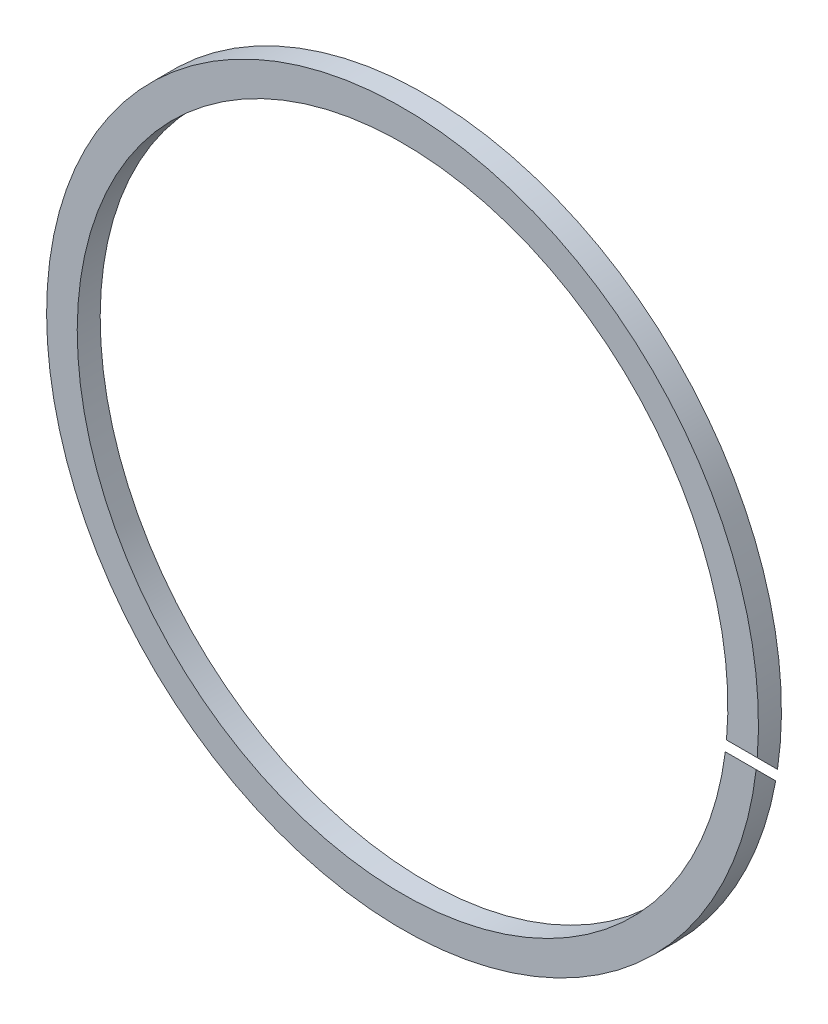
ISO-10303-21;
HEADER;
FILE_DESCRIPTION(('STEP AP214'),'2;1');
FILE_NAME('part.step','',(''),(''),'','','');
FILE_SCHEMA(('AUTOMOTIVE_DESIGN { 1 0 10303 214 1 1 1 1 }'));
ENDSEC;
DATA;
#1=APPLICATION_CONTEXT('core data for automotive mechanical design processes');
#2=APPLICATION_PROTOCOL_DEFINITION('international standard','automotive_design',2000,#1);
#3=PRODUCT_CONTEXT('',#1,'mechanical');
#4=PRODUCT('Part','Part','',(#3));
#5=PRODUCT_RELATED_PRODUCT_CATEGORY('part','',(#4));
#6=PRODUCT_DEFINITION_FORMATION('','',#4);
#7=PRODUCT_DEFINITION_CONTEXT('part definition',#1,'design');
#8=PRODUCT_DEFINITION('design','',#6,#7);
#9=PRODUCT_DEFINITION_SHAPE('','',#8);
#10=(LENGTH_UNIT() NAMED_UNIT(*) SI_UNIT(.MILLI.,.METRE.));
#11=(NAMED_UNIT(*) PLANE_ANGLE_UNIT() SI_UNIT($,.RADIAN.));
#12=(NAMED_UNIT(*) SI_UNIT($,.STERADIAN.) SOLID_ANGLE_UNIT());
#13=UNCERTAINTY_MEASURE_WITH_UNIT(LENGTH_MEASURE(1.E-05),#10,'distance_accuracy_value','');
#14=(GEOMETRIC_REPRESENTATION_CONTEXT(3) GLOBAL_UNCERTAINTY_ASSIGNED_CONTEXT((#13)) GLOBAL_UNIT_ASSIGNED_CONTEXT((#10,
#11,#12)) REPRESENTATION_CONTEXT('',''));
#15=CARTESIAN_POINT('',(0.,0.,0.));
#16=DIRECTION('',(0.,0.,1.));
#17=DIRECTION('',(1.,0.,0.));
#18=AXIS2_PLACEMENT_3D('',#15,#16,#17);
#19=CARTESIAN_POINT('',(0.,0.,1.5));
#20=DIRECTION('',(0.,0.,1.));
#21=DIRECTION('',(1.,0.,0.));
#22=AXIS2_PLACEMENT_3D('',#19,#20,#21);
#23=PLANE('',#22);
#24=DIRECTION('',(1.,0.,0.));
#25=VECTOR('',#24,1.);
#26=CARTESIAN_POINT('',(46.501,-3.88899602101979,1.5));
#27=LINE('',#26,#25);
#28=CARTESIAN_POINT('',(42.3216931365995,-3.88899602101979,1.5));
#29=VERTEX_POINT('',#28);
#30=CARTESIAN_POINT('',(46.3370878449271,-3.88899602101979,1.5));
#31=VERTEX_POINT('',#30);
#32=EDGE_CURVE('E53',#29,#31,#27,.T.);
#33=ORIENTED_EDGE('',*,*,#32,.T.);
#34=CARTESIAN_POINT('',(0.,0.,1.5));
#35=DIRECTION('',(0.,0.,1.));
#36=DIRECTION('',(1.,0.,0.));
#37=AXIS2_PLACEMENT_3D('',#34,#35,#36);
#38=CIRCLE('',#37,46.5);
#39=CARTESIAN_POINT('',(46.1966012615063,-5.30320958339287,1.5));
#40=VERTEX_POINT('',#39);
#41=EDGE_CURVE('E11',#31,#40,#38,.T.);
#42=ORIENTED_EDGE('',*,*,#41,.T.);
#43=DIRECTION('',(1.,0.,0.));
#44=VECTOR('',#43,1.);
#45=CARTESIAN_POINT('',(46.501,-5.30320958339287,1.5));
#46=LINE('',#45,#44);
#47=CARTESIAN_POINT('',(42.167830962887,-5.30320958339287,1.5));
#48=VERTEX_POINT('',#47);
#49=EDGE_CURVE('E71',#48,#40,#46,.T.);
#50=ORIENTED_EDGE('',*,*,#49,.F.);
#51=CARTESIAN_POINT('',(0.,0.,1.5));
#52=DIRECTION('',(0.,0.,1.));
#53=DIRECTION('',(1.,0.,0.));
#54=AXIS2_PLACEMENT_3D('',#51,#52,#53);
#55=CIRCLE('',#54,42.5);
#56=EDGE_CURVE('E81',#29,#48,#55,.T.);
#57=ORIENTED_EDGE('',*,*,#56,.F.);
#58=EDGE_LOOP('',(#33,#42,#50,#57));
#59=FACE_BOUND('',#58,.T.);
#60=ADVANCED_FACE('F30',(#59),#23,.T.);
#61=CARTESIAN_POINT('',(0.,0.,-1.5));
#62=DIRECTION('',(0.,0.,1.));
#63=DIRECTION('',(1.,0.,0.));
#64=AXIS2_PLACEMENT_3D('',#61,#62,#63);
#65=PLANE('',#64);
#66=CARTESIAN_POINT('',(0.,0.,-1.5));
#67=DIRECTION('',(0.,0.,1.));
#68=DIRECTION('',(1.,0.,0.));
#69=AXIS2_PLACEMENT_3D('',#66,#67,#68);
#70=CIRCLE('',#69,46.5);
#71=CARTESIAN_POINT('',(45.9868647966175,-6.88899602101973,-1.5));
#72=VERTEX_POINT('',#71);
#73=CARTESIAN_POINT('',(45.752668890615,-8.30320958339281,-1.5));
#74=VERTEX_POINT('',#73);
#75=EDGE_CURVE('E34',#72,#74,#70,.T.);
#76=ORIENTED_EDGE('',*,*,#75,.F.);
#77=DIRECTION('',(1.,0.,0.));
#78=VECTOR('',#77,1.);
#79=CARTESIAN_POINT('',(46.501,-6.88899602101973,-1.5));
#80=LINE('',#79,#78);
#81=CARTESIAN_POINT('',(41.9379509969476,-6.88899602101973,-1.5));
#82=VERTEX_POINT('',#81);
#83=EDGE_CURVE('E94',#82,#72,#80,.T.);
#84=ORIENTED_EDGE('',*,*,#83,.F.);
#85=CARTESIAN_POINT('',(0.,0.,-1.5));
#86=DIRECTION('',(0.,0.,1.));
#87=DIRECTION('',(1.,0.,0.));
#88=AXIS2_PLACEMENT_3D('',#85,#86,#87);
#89=CIRCLE('',#88,42.5);
#90=CARTESIAN_POINT('',(41.6810113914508,-8.30320958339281,-1.5));
#91=VERTEX_POINT('',#90);
#92=EDGE_CURVE('E86',#82,#91,#89,.T.);
#93=ORIENTED_EDGE('',*,*,#92,.T.);
#94=DIRECTION('',(1.,0.,0.));
#95=VECTOR('',#94,1.);
#96=CARTESIAN_POINT('',(46.501,-8.30320958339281,-1.5));
#97=LINE('',#96,#95);
#98=EDGE_CURVE('E45',#91,#74,#97,.T.);
#99=ORIENTED_EDGE('',*,*,#98,.T.);
#100=EDGE_LOOP('',(#76,#84,#93,#99));
#101=FACE_BOUND('',#100,.T.);
#102=ADVANCED_FACE('F102',(#101),#65,.F.);
#103=CARTESIAN_POINT('',(0.,0.,1.5));
#104=DIRECTION('',(0.,0.,-1.));
#105=DIRECTION('',(-1.,0.,0.));
#106=AXIS2_PLACEMENT_3D('',#103,#104,#105);
#107=CYLINDRICAL_SURFACE('',#106,46.5);
#108=ORIENTED_EDGE('',*,*,#41,.F.);
#109=CARTESIAN_POINT('',(0.,0.,5.38899602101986));
#110=DIRECTION('',(0.,0.707106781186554,-0.707106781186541));
#111=DIRECTION('',(0.,-0.707106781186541,-0.707106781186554));
#112=AXIS2_PLACEMENT_3D('',#109,#110,#111);
#113=ELLIPSE('',#112,65.7609306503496,46.5);
#114=EDGE_CURVE('E89',#72,#31,#113,.F.);
#115=ORIENTED_EDGE('',*,*,#114,.F.);
#116=ORIENTED_EDGE('',*,*,#75,.T.);
#117=CARTESIAN_POINT('',(0.,0.,6.80320958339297));
#118=DIRECTION('',(0.,0.707106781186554,-0.707106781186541));
#119=DIRECTION('',(0.,-0.707106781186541,-0.707106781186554));
#120=AXIS2_PLACEMENT_3D('',#117,#118,#119);
#121=ELLIPSE('',#120,65.7609306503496,46.5);
#122=EDGE_CURVE('E77',#74,#40,#121,.F.);
#123=ORIENTED_EDGE('',*,*,#122,.T.);
#124=EDGE_LOOP('',(#108,#115,#116,#123));
#125=FACE_BOUND('',#124,.T.);
#126=ADVANCED_FACE('F32',(#125),#107,.T.);
#127=CARTESIAN_POINT('',(0.,0.,1.5));
#128=DIRECTION('',(0.,0.,-1.));
#129=DIRECTION('',(-1.,0.,0.));
#130=AXIS2_PLACEMENT_3D('',#127,#128,#129);
#131=CYLINDRICAL_SURFACE('',#130,42.5);
#132=CARTESIAN_POINT('',(0.,0.,5.38899602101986));
#133=DIRECTION('',(0.,0.707106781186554,-0.707106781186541));
#134=DIRECTION('',(0.,-0.707106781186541,-0.707106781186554));
#135=AXIS2_PLACEMENT_3D('',#132,#133,#134);
#136=ELLIPSE('',#135,60.1040764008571,42.5);
#137=EDGE_CURVE('E83',#82,#29,#136,.F.);
#138=ORIENTED_EDGE('',*,*,#137,.T.);
#139=ORIENTED_EDGE('',*,*,#56,.T.);
#140=CARTESIAN_POINT('',(0.,0.,6.80320958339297));
#141=DIRECTION('',(0.,0.707106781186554,-0.707106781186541));
#142=DIRECTION('',(0.,-0.707106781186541,-0.707106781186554));
#143=AXIS2_PLACEMENT_3D('',#140,#141,#142);
#144=ELLIPSE('',#143,60.1040764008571,42.5);
#145=EDGE_CURVE('E68',#91,#48,#144,.F.);
#146=ORIENTED_EDGE('',*,*,#145,.F.);
#147=ORIENTED_EDGE('',*,*,#92,.F.);
#148=EDGE_LOOP('',(#138,#139,#146,#147));
#149=FACE_BOUND('',#148,.T.);
#150=ADVANCED_FACE('F85',(#149),#131,.F.);
#151=CARTESIAN_POINT('',(46.501,-3.35355339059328,3.44965619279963));
#152=DIRECTION('',(0.,0.707106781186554,-0.707106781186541));
#153=DIRECTION('',(0.,0.707106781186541,0.707106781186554));
#154=AXIS2_PLACEMENT_3D('',#151,#152,#153);
#155=PLANE('',#154);
#156=ORIENTED_EDGE('',*,*,#98,.F.);
#157=ORIENTED_EDGE('',*,*,#145,.T.);
#158=ORIENTED_EDGE('',*,*,#49,.T.);
#159=ORIENTED_EDGE('',*,*,#122,.F.);
#160=EDGE_LOOP('',(#156,#157,#158,#159));
#161=FACE_BOUND('',#160,.T.);
#162=ADVANCED_FACE('F70',(#161),#155,.T.);
#163=CARTESIAN_POINT('',(46.501,-2.64644660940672,2.74254941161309));
#164=DIRECTION('',(0.,0.707106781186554,-0.707106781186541));
#165=DIRECTION('',(0.,0.707106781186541,0.707106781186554));
#166=AXIS2_PLACEMENT_3D('',#163,#164,#165);
#167=PLANE('',#166);
#168=ORIENTED_EDGE('',*,*,#114,.T.);
#169=ORIENTED_EDGE('',*,*,#32,.F.);
#170=ORIENTED_EDGE('',*,*,#137,.F.);
#171=ORIENTED_EDGE('',*,*,#83,.T.);
#172=EDGE_LOOP('',(#168,#169,#170,#171));
#173=FACE_BOUND('',#172,.T.);
#174=ADVANCED_FACE('F104',(#173),#167,.F.);
#175=CLOSED_SHELL('',(#60,#102,#126,#150,#162,#174));
#176=MANIFOLD_SOLID_BREP('B2',#175);
#177=ADVANCED_BREP_SHAPE_REPRESENTATION('',(#18,#176),#14);
#178=SHAPE_DEFINITION_REPRESENTATION(#9,#177);
ENDSEC;
END-ISO-10303-21;
